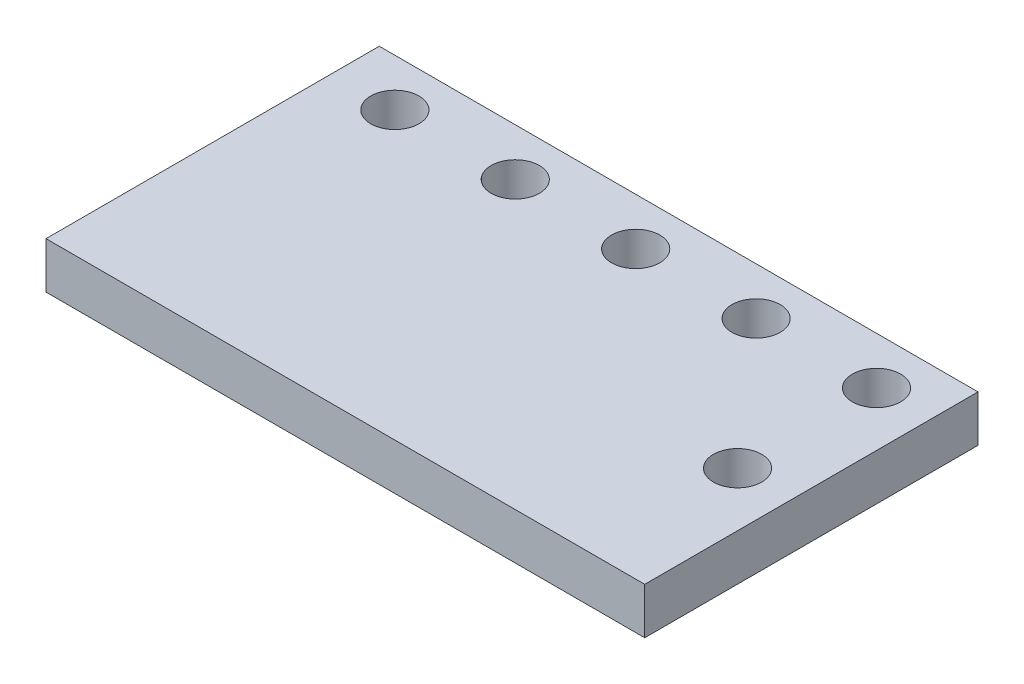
from build123d import *

# Parameters (mm, degrees)
SKETCH1_W           = 164.179790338
SKETCH1_H           = 91.39072073
EXTRUDE1_DEPTH      = 12.7
SKETCH2_R           = 6.614511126
CUT_EXTRUDE1_DEPTH  = 95.805626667
LPATTERN2_COUNT     = 5
LPATTERN2_PITCH     = 33.02
LPATTERN2_COL_COUNT = 2
LPATTERN2_COL_PITCH = 38.1


with BuildPart() as part:
    # Sketch1 → Extrude1 (new body)
    with BuildSketch(Plane(origin=(0, 0, 0), x_dir=(1, 0, 0), z_dir=(0, 1, 0))):
        Rectangle(SKETCH1_W, SKETCH1_H)
    extrude(amount=EXTRUDE1_DEPTH)

    # Sketch2 → Cut-Extrude1 (cut, through all)
    with BuildSketch(Plane(origin=(0, 12.7, 0), x_dir=(-1, 0, 0), z_dir=(0, 1, 0))):
        with Locations(Location((-67.246984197, -32.709258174, 0), (0, 0, 90))):
            Circle(SKETCH2_R)
    cut_extrude1 = extrude(amount=-CUT_EXTRUDE1_DEPTH, mode=Mode.SUBTRACT)

    # LPattern2: Cut-Extrude1 ×5
    with Locations(*[(-i * LPATTERN2_PITCH, 0, 0) for i in range(1, LPATTERN2_COUNT)]):
        add(cut_extrude1, mode=Mode.SUBTRACT)

    # LPattern2 col: Cut-Extrude1 ×2
    with Locations(*[(0, 0, i * LPATTERN2_COL_PITCH) for i in range(1, LPATTERN2_COL_COUNT)]):
        add(cut_extrude1, mode=Mode.SUBTRACT)


solid = part.part
